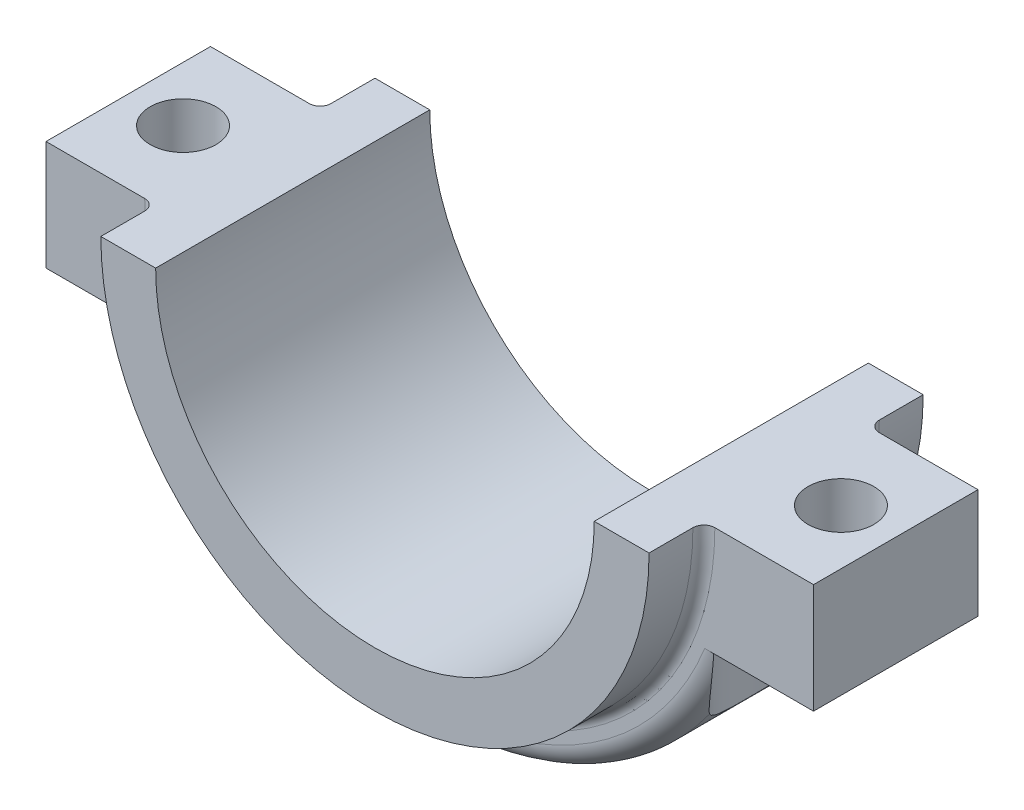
ISO-10303-21;
HEADER;
FILE_DESCRIPTION(('STEP AP214'),'2;1');
FILE_NAME('part.step','',(''),(''),'','','');
FILE_SCHEMA(('AUTOMOTIVE_DESIGN { 1 0 10303 214 1 1 1 1 }'));
ENDSEC;
DATA;
#1=APPLICATION_CONTEXT('core data for automotive mechanical design processes');
#2=APPLICATION_PROTOCOL_DEFINITION('international standard','automotive_design',2000,#1);
#3=PRODUCT_CONTEXT('',#1,'mechanical');
#4=PRODUCT('Part','Part','',(#3));
#5=PRODUCT_RELATED_PRODUCT_CATEGORY('part','',(#4));
#6=PRODUCT_DEFINITION_FORMATION('','',#4);
#7=PRODUCT_DEFINITION_CONTEXT('part definition',#1,'design');
#8=PRODUCT_DEFINITION('design','',#6,#7);
#9=PRODUCT_DEFINITION_SHAPE('','',#8);
#10=(LENGTH_UNIT() NAMED_UNIT(*) SI_UNIT(.MILLI.,.METRE.));
#11=(NAMED_UNIT(*) PLANE_ANGLE_UNIT() SI_UNIT($,.RADIAN.));
#12=(NAMED_UNIT(*) SI_UNIT($,.STERADIAN.) SOLID_ANGLE_UNIT());
#13=UNCERTAINTY_MEASURE_WITH_UNIT(LENGTH_MEASURE(1.E-05),#10,'distance_accuracy_value','');
#14=(GEOMETRIC_REPRESENTATION_CONTEXT(3) GLOBAL_UNCERTAINTY_ASSIGNED_CONTEXT((#13)) GLOBAL_UNIT_ASSIGNED_CONTEXT((#10,
#11,#12)) REPRESENTATION_CONTEXT('',''));
#15=CARTESIAN_POINT('',(0.,0.,0.));
#16=DIRECTION('',(0.,0.,1.));
#17=DIRECTION('',(1.,0.,0.));
#18=AXIS2_PLACEMENT_3D('',#15,#16,#17);
#19=CARTESIAN_POINT('',(0.,0.,15.));
#20=DIRECTION('',(0.,0.,-1.));
#21=DIRECTION('',(-1.,0.,0.));
#22=AXIS2_PLACEMENT_3D('',#19,#20,#21);
#23=CYLINDRICAL_SURFACE('',#22,58.);
#24=CARTESIAN_POINT('',(52.,-25.6904651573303,15.));
#25=CARTESIAN_POINT('',(51.8464410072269,-26.0012966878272,14.9180901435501));
#26=CARTESIAN_POINT('',(51.6905222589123,-26.3098603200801,14.8319155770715));
#27=CARTESIAN_POINT('',(51.3743247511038,-26.9220597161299,14.6502925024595));
#28=CARTESIAN_POINT('',(51.2140451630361,-27.2256945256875,14.5548422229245));
#29=CARTESIAN_POINT('',(50.8891075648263,-27.8283353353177,14.3536834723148));
#30=CARTESIAN_POINT('',(50.7244389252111,-28.127326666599,14.2479480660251));
#31=CARTESIAN_POINT('',(50.3916528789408,-28.7192737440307,14.025679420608));
#32=CARTESIAN_POINT('',(50.2235356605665,-29.0122298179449,13.9091467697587));
#33=CARTESIAN_POINT('',(49.7104094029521,-29.8887420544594,13.5389800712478));
#34=CARTESIAN_POINT('',(49.360814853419,-30.4621907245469,13.2673101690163));
#35=CARTESIAN_POINT('',(48.6559783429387,-31.5757674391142,12.6698951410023));
#36=CARTESIAN_POINT('',(48.3007436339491,-32.115934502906,12.3442150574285));
#37=CARTESIAN_POINT('',(47.7239295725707,-32.963370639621,11.7642584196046));
#38=CARTESIAN_POINT('',(47.5016328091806,-33.2827295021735,11.5282838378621));
#39=CARTESIAN_POINT('',(47.0604799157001,-33.9036295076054,11.0308360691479));
#40=CARTESIAN_POINT('',(46.8416239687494,-34.2051697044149,10.7693615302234));
#41=CARTESIAN_POINT('',(46.4112812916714,-34.7868273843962,10.2209439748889));
#42=CARTESIAN_POINT('',(46.1997677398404,-35.0670286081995,9.93411119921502));
#43=CARTESIAN_POINT('',(45.7865955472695,-35.6048113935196,9.33337846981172));
#44=CARTESIAN_POINT('',(45.5849352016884,-35.862396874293,9.01948322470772));
#45=CARTESIAN_POINT('',(45.2260091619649,-36.3136017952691,8.41618811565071));
#46=CARTESIAN_POINT('',(45.066755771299,-36.5109043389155,8.13072465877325));
#47=CARTESIAN_POINT('',(44.7604376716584,-36.8857939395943,7.54096141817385));
#48=CARTESIAN_POINT('',(44.6133704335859,-37.0633850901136,7.2366655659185));
#49=CARTESIAN_POINT('',(44.3338642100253,-37.3972719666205,6.6098417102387));
#50=CARTESIAN_POINT('',(44.2014350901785,-37.5535533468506,6.28730162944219));
#51=CARTESIAN_POINT('',(43.9538884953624,-37.8429911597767,5.62557308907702));
#52=CARTESIAN_POINT('',(43.8387711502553,-37.9761474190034,5.28638450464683));
#53=CARTESIAN_POINT('',(43.6275035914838,-38.2186738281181,4.59069644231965));
#54=CARTESIAN_POINT('',(43.531504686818,-38.3278548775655,4.23408469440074));
#55=CARTESIAN_POINT('',(43.3618321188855,-38.5197086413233,3.50857971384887));
#56=CARTESIAN_POINT('',(43.2881589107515,-38.6023808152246,3.13968623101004));
#57=CARTESIAN_POINT('',(43.1650248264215,-38.7400203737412,2.39304534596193));
#58=CARTESIAN_POINT('',(43.1155473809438,-38.7950067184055,2.01530418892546));
#59=CARTESIAN_POINT('',(43.0420315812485,-38.8765555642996,1.25433467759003));
#60=CARTESIAN_POINT('',(43.0179896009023,-38.9031221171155,0.871107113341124));
#61=CARTESIAN_POINT('',(42.9974413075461,-38.9258292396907,0.154406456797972));
#62=CARTESIAN_POINT('',(42.9976832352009,-38.9255628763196,-0.178868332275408));
#63=CARTESIAN_POINT('',(43.0177090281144,-38.9034310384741,-0.844086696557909));
#64=CARTESIAN_POINT('',(43.0374907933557,-38.8815678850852,-1.17603041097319));
#65=CARTESIAN_POINT('',(43.0961909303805,-38.8164943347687,-1.83602642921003));
#66=CARTESIAN_POINT('',(43.1351052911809,-38.773288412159,-2.1640795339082));
#67=CARTESIAN_POINT('',(43.2313017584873,-38.6660022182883,-2.81401500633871));
#68=CARTESIAN_POINT('',(43.2885841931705,-38.6019215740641,-3.13589726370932));
#69=CARTESIAN_POINT('',(43.4186894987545,-38.4555160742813,-3.76297559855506));
#70=CARTESIAN_POINT('',(43.4910639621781,-38.3737154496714,-4.06838787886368));
#71=CARTESIAN_POINT('',(43.6509444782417,-38.19174912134,-4.66959762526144));
#72=CARTESIAN_POINT('',(43.7384500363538,-38.0915840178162,-4.96539540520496));
#73=CARTESIAN_POINT('',(43.9271768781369,-37.8737887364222,-5.54594690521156));
#74=CARTESIAN_POINT('',(44.0283978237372,-37.7561589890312,-5.83070089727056));
#75=CARTESIAN_POINT('',(44.2430666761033,-37.5043788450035,-6.38813845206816));
#76=CARTESIAN_POINT('',(44.356519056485,-37.3702224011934,-6.66081754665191));
#77=CARTESIAN_POINT('',(44.6058099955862,-37.0724020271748,-7.21952137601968));
#78=CARTESIAN_POINT('',(44.7427528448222,-36.9071319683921,-7.50419817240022));
#79=CARTESIAN_POINT('',(45.0274090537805,-36.559309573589,-8.05719278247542));
#80=CARTESIAN_POINT('',(45.1751266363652,-36.3767504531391,-8.32550410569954));
#81=CARTESIAN_POINT('',(45.6313417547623,-35.8052657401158,-9.10515657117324));
#82=CARTESIAN_POINT('',(45.9530506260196,-35.392357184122,-9.59154106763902));
#83=CARTESIAN_POINT('',(46.5506820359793,-34.6010061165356,-10.4076433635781));
#84=CARTESIAN_POINT('',(46.8230636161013,-34.2319181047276,-10.7493154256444));
#85=CARTESIAN_POINT('',(47.3746924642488,-33.4643354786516,-11.3921436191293));
#86=CARTESIAN_POINT('',(47.6539433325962,-33.0658252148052,-11.6932779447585));
#87=CARTESIAN_POINT('',(48.2149582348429,-32.2423191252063,-12.2585506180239));
#88=CARTESIAN_POINT('',(48.4967277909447,-31.8172281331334,-12.5225435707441));
#89=CARTESIAN_POINT('',(49.0574716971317,-30.9456443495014,-13.0153897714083));
#90=CARTESIAN_POINT('',(49.3364466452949,-30.4991562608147,-13.2442506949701));
#91=CARTESIAN_POINT('',(49.8220028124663,-29.6973399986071,-13.619047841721));
#92=CARTESIAN_POINT('',(50.0298714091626,-29.3458875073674,-13.7716956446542));
#93=CARTESIAN_POINT('',(50.4409685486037,-28.6335081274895,-14.0601549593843));
#94=CARTESIAN_POINT('',(50.6441972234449,-28.2725815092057,-14.1959669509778));
#95=CARTESIAN_POINT('',(51.0432010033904,-27.5456328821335,-14.4509983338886));
#96=CARTESIAN_POINT('',(51.2390274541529,-27.1796882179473,-14.5703587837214));
#97=CARTESIAN_POINT('',(51.624395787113,-26.4404214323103,-14.7952288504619));
#98=CARTESIAN_POINT('',(51.8139391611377,-26.0671010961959,-14.9007417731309));
#99=CARTESIAN_POINT('',(52.,-25.6904651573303,-15.));
#100=B_SPLINE_CURVE_WITH_KNOTS('',3,(#24,#25,#26,#27,#28,#29,#30,#31,#32,#33,#34,#35,#36,#37,
#38,#39,#40,#41,#42,#43,#44,#45,#46,#47,#48,#49,#50,#51,#52,#53,#54,#55,#56,#57,#58,#59,#60,#61,
#62,#63,#64,#65,#66,#67,#68,#69,#70,#71,#72,#73,#74,#75,#76,#77,#78,#79,#80,#81,#82,#83,#84,#85,
#86,#87,#88,#89,#90,#91,#92,#93,#94,#95,#96,#97,#98,#99),.UNSPECIFIED.,.F.,.F.,(4,2,2,2,2,2,2,2,
2,2,2,2,2,2,2,2,2,2,2,2,2,2,2,2,2,2,2,2,2,2,2,2,2,2,2,2,2,4),(0.,1.06870145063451,
2.13760739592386,3.20939213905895,4.28111852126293,6.45200584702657,8.62029759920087,
9.98458948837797,11.3489537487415,12.7076537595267,14.0661178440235,15.2104802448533,
16.354604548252,17.4994953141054,18.6443946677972,19.7980234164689,20.9516756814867,
22.1045368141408,23.2572335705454,24.2558143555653,25.2542878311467,26.2525520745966,
27.2508341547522,28.2228575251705,29.1948491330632,30.1668167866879,31.139141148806,
32.207644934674,33.2765697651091,35.4132354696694,37.1269886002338,38.8416599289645,
40.5628671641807,42.2836978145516,43.5910217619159,44.89830844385,46.1935772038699,
47.4885361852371),.UNSPECIFIED.);
#101=CARTESIAN_POINT('',(47.0385186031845,-33.9319579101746,11.0000000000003));
#102=VERTEX_POINT('',#101);
#103=CARTESIAN_POINT('',(47.0385186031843,-33.931957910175,-11.));
#104=VERTEX_POINT('',#103);
#105=EDGE_CURVE('E411',#102,#104,#100,.T.);
#106=ORIENTED_EDGE('',*,*,#105,.F.);
#107=CARTESIAN_POINT('',(0.,0.,11.));
#108=DIRECTION('',(0.,0.,1.));
#109=DIRECTION('',(1.,0.,0.));
#110=AXIS2_PLACEMENT_3D('',#107,#108,#109);
#111=CIRCLE('',#110,58.);
#112=CARTESIAN_POINT('',(-47.0385186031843,-33.931957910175,11.));
#113=VERTEX_POINT('',#112);
#114=EDGE_CURVE('E302',#102,#113,#111,.F.);
#115=ORIENTED_EDGE('',*,*,#114,.T.);
#116=CARTESIAN_POINT('',(-52.,-25.6904651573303,-15.));
#117=CARTESIAN_POINT('',(-51.8464410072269,-26.0012966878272,-14.9180901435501));
#118=CARTESIAN_POINT('',(-51.6905222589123,-26.3098603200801,-14.8319155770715));
#119=CARTESIAN_POINT('',(-51.3743247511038,-26.9220597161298,-14.6502925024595));
#120=CARTESIAN_POINT('',(-51.2140451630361,-27.2256945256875,-14.5548422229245));
#121=CARTESIAN_POINT('',(-50.8891075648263,-27.8283353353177,-14.3536834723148));
#122=CARTESIAN_POINT('',(-50.7244389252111,-28.127326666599,-14.2479480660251));
#123=CARTESIAN_POINT('',(-50.3916528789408,-28.7192737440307,-14.025679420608));
#124=CARTESIAN_POINT('',(-50.2235356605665,-29.0122298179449,-13.9091467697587));
#125=CARTESIAN_POINT('',(-49.7104094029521,-29.8887420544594,-13.5389800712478));
#126=CARTESIAN_POINT('',(-49.360814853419,-30.4621907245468,-13.2673101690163));
#127=CARTESIAN_POINT('',(-48.6559783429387,-31.5757674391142,-12.6698951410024));
#128=CARTESIAN_POINT('',(-48.3007436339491,-32.115934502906,-12.3442150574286));
#129=CARTESIAN_POINT('',(-47.7239295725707,-32.963370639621,-11.7642584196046));
#130=CARTESIAN_POINT('',(-47.5016328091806,-33.2827295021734,-11.5282838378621));
#131=CARTESIAN_POINT('',(-47.0604799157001,-33.9036295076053,-11.0308360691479));
#132=CARTESIAN_POINT('',(-46.8416239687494,-34.2051697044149,-10.7693615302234));
#133=CARTESIAN_POINT('',(-46.4112812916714,-34.7868273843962,-10.2209439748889));
#134=CARTESIAN_POINT('',(-46.1997677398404,-35.0670286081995,-9.93411119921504));
#135=CARTESIAN_POINT('',(-45.7865955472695,-35.6048113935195,-9.33337846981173));
#136=CARTESIAN_POINT('',(-45.5849352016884,-35.862396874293,-9.01948322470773));
#137=CARTESIAN_POINT('',(-45.226009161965,-36.3136017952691,-8.41618811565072));
#138=CARTESIAN_POINT('',(-45.066755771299,-36.5109043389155,-8.13072465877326));
#139=CARTESIAN_POINT('',(-44.7604376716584,-36.8857939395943,-7.54096141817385));
#140=CARTESIAN_POINT('',(-44.6133704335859,-37.0633850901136,-7.23666556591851));
#141=CARTESIAN_POINT('',(-44.3338642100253,-37.3972719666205,-6.60984171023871));
#142=CARTESIAN_POINT('',(-44.2014350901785,-37.5535533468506,-6.2873016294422));
#143=CARTESIAN_POINT('',(-43.9538884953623,-37.8429911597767,-5.62557308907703));
#144=CARTESIAN_POINT('',(-43.8387711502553,-37.9761474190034,-5.28638450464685));
#145=CARTESIAN_POINT('',(-43.6275035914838,-38.2186738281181,-4.59069644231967));
#146=CARTESIAN_POINT('',(-43.531504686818,-38.3278548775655,-4.23408469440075));
#147=CARTESIAN_POINT('',(-43.3618321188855,-38.5197086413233,-3.50857971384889));
#148=CARTESIAN_POINT('',(-43.2881589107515,-38.6023808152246,-3.13968623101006));
#149=CARTESIAN_POINT('',(-43.1650248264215,-38.7400203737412,-2.39304534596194));
#150=CARTESIAN_POINT('',(-43.1155473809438,-38.7950067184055,-2.01530418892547));
#151=CARTESIAN_POINT('',(-43.0420315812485,-38.8765555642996,-1.25433467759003));
#152=CARTESIAN_POINT('',(-43.0179896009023,-38.9031221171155,-0.871107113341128));
#153=CARTESIAN_POINT('',(-42.9974413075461,-38.9258292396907,-0.154406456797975));
#154=CARTESIAN_POINT('',(-42.9976832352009,-38.9255628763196,0.178868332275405));
#155=CARTESIAN_POINT('',(-43.0177090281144,-38.9034310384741,0.844086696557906));
#156=CARTESIAN_POINT('',(-43.0374907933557,-38.8815678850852,1.17603041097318));
#157=CARTESIAN_POINT('',(-43.0961909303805,-38.8164943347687,1.83602642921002));
#158=CARTESIAN_POINT('',(-43.1351052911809,-38.773288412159,2.1640795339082));
#159=CARTESIAN_POINT('',(-43.2313017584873,-38.6660022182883,2.81401500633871));
#160=CARTESIAN_POINT('',(-43.2885841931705,-38.6019215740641,3.13589726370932));
#161=CARTESIAN_POINT('',(-43.4186894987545,-38.4555160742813,3.76297559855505));
#162=CARTESIAN_POINT('',(-43.4910639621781,-38.3737154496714,4.06838787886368));
#163=CARTESIAN_POINT('',(-43.6509444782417,-38.19174912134,4.66959762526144));
#164=CARTESIAN_POINT('',(-43.7384500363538,-38.0915840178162,4.96539540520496));
#165=CARTESIAN_POINT('',(-43.9271768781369,-37.8737887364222,5.54594690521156));
#166=CARTESIAN_POINT('',(-44.0283978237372,-37.7561589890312,5.83070089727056));
#167=CARTESIAN_POINT('',(-44.2430666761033,-37.5043788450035,6.38813845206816));
#168=CARTESIAN_POINT('',(-44.356519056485,-37.3702224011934,6.6608175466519));
#169=CARTESIAN_POINT('',(-44.6058099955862,-37.0724020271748,7.21952137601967));
#170=CARTESIAN_POINT('',(-44.7427528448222,-36.9071319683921,7.50419817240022));
#171=CARTESIAN_POINT('',(-45.0274090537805,-36.559309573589,8.05719278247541));
#172=CARTESIAN_POINT('',(-45.1751266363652,-36.3767504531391,8.32550410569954));
#173=CARTESIAN_POINT('',(-45.6313417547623,-35.8052657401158,9.10515657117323));
#174=CARTESIAN_POINT('',(-45.9530506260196,-35.392357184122,9.59154106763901));
#175=CARTESIAN_POINT('',(-46.5506820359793,-34.6010061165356,10.4076433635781));
#176=CARTESIAN_POINT('',(-46.8230636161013,-34.2319181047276,10.7493154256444));
#177=CARTESIAN_POINT('',(-47.3746924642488,-33.4643354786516,11.3921436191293));
#178=CARTESIAN_POINT('',(-47.6539433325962,-33.0658252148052,11.6932779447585));
#179=CARTESIAN_POINT('',(-48.2149582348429,-32.2423191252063,12.2585506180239));
#180=CARTESIAN_POINT('',(-48.4967277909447,-31.8172281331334,12.5225435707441));
#181=CARTESIAN_POINT('',(-49.0574716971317,-30.9456443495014,13.0153897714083));
#182=CARTESIAN_POINT('',(-49.3364466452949,-30.4991562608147,13.2442506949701));
#183=CARTESIAN_POINT('',(-49.8220028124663,-29.6973399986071,13.619047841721));
#184=CARTESIAN_POINT('',(-50.0298714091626,-29.3458875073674,13.7716956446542));
#185=CARTESIAN_POINT('',(-50.4409685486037,-28.6335081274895,14.0601549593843));
#186=CARTESIAN_POINT('',(-50.6441972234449,-28.2725815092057,14.1959669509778));
#187=CARTESIAN_POINT('',(-51.0432010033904,-27.5456328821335,14.4509983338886));
#188=CARTESIAN_POINT('',(-51.2390274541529,-27.1796882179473,14.5703587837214));
#189=CARTESIAN_POINT('',(-51.624395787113,-26.4404214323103,14.7952288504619));
#190=CARTESIAN_POINT('',(-51.8139391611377,-26.0671010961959,14.9007417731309));
#191=CARTESIAN_POINT('',(-52.,-25.6904651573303,15.));
#192=B_SPLINE_CURVE_WITH_KNOTS('',3,(#116,#117,#118,#119,#120,#121,#122,#123,#124,#125,#126,
#127,#128,#129,#130,#131,#132,#133,#134,#135,#136,#137,#138,#139,#140,#141,#142,#143,#144,#145,
#146,#147,#148,#149,#150,#151,#152,#153,#154,#155,#156,#157,#158,#159,#160,#161,#162,#163,#164,
#165,#166,#167,#168,#169,#170,#171,#172,#173,#174,#175,#176,#177,#178,#179,#180,#181,#182,#183,
#184,#185,#186,#187,#188,#189,#190,#191),.UNSPECIFIED.,.F.,.F.,(4,2,2,2,2,2,2,2,2,2,2,2,2,2,2,2,
2,2,2,2,2,2,2,2,2,2,2,2,2,2,2,2,2,2,2,2,2,4),(0.,1.06870145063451,2.13760739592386,
3.20939213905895,4.28111852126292,6.45200584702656,8.62029759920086,9.98458948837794,
11.3489537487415,12.7076537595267,14.0661178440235,15.2104802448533,16.354604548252,
17.4994953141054,18.6443946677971,19.7980234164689,20.9516756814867,22.1045368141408,
23.2572335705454,24.2558143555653,25.2542878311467,26.2525520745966,27.2508341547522,
28.2228575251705,29.1948491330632,30.1668167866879,31.139141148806,32.207644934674,
33.2765697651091,35.4132354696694,37.1269886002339,38.8416599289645,40.5628671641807,
42.2836978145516,43.5910217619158,44.89830844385,46.1935772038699,47.4885361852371),.UNSPECIFIED.);
#193=CARTESIAN_POINT('',(-47.0385186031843,-33.931957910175,-11.));
#194=VERTEX_POINT('',#193);
#195=EDGE_CURVE('E270',#194,#113,#192,.T.);
#196=ORIENTED_EDGE('',*,*,#195,.F.);
#197=CARTESIAN_POINT('',(0.,0.,-11.));
#198=DIRECTION('',(0.,0.,1.));
#199=DIRECTION('',(1.,0.,0.));
#200=AXIS2_PLACEMENT_3D('',#197,#198,#199);
#201=CIRCLE('',#200,58.);
#202=EDGE_CURVE('E413',#194,#104,#201,.T.);
#203=ORIENTED_EDGE('',*,*,#202,.T.);
#204=EDGE_LOOP('',(#106,#115,#196,#203));
#205=FACE_BOUND('',#204,.T.);
#206=ADVANCED_FACE('F61',(#205),#23,.T.);
#207=CARTESIAN_POINT('',(0.,0.,15.));
#208=DIRECTION('',(0.,0.,1.));
#209=DIRECTION('',(1.,0.,0.));
#210=AXIS2_PLACEMENT_3D('',#207,#208,#209);
#211=PLANE('',#210);
#212=DIRECTION('',(1.,0.,0.));
#213=VECTOR('',#212,1.);
#214=CARTESIAN_POINT('',(0.,0.,15.));
#215=LINE('',#214,#213);
#216=CARTESIAN_POINT('',(52.,0.,15.));
#217=VERTEX_POINT('',#216);
#218=CARTESIAN_POINT('',(70.,0.,15.));
#219=VERTEX_POINT('',#218);
#220=EDGE_CURVE('E236',#217,#219,#215,.T.);
#221=ORIENTED_EDGE('',*,*,#220,.F.);
#222=CARTESIAN_POINT('',(0.,0.,15.));
#223=DIRECTION('',(0.,0.,1.));
#224=DIRECTION('',(1.,0.,0.));
#225=AXIS2_PLACEMENT_3D('',#222,#223,#224);
#226=CIRCLE('',#225,52.);
#227=CARTESIAN_POINT('',(-52.,0.,15.));
#228=VERTEX_POINT('',#227);
#229=EDGE_CURVE('E76',#217,#228,#226,.F.);
#230=ORIENTED_EDGE('',*,*,#229,.T.);
#231=DIRECTION('',(1.,0.,0.));
#232=VECTOR('',#231,1.);
#233=CARTESIAN_POINT('',(0.,0.,15.));
#234=LINE('',#233,#232);
#235=CARTESIAN_POINT('',(-70.,0.,15.));
#236=VERTEX_POINT('',#235);
#237=EDGE_CURVE('E217',#236,#228,#234,.T.);
#238=ORIENTED_EDGE('',*,*,#237,.F.);
#239=DIRECTION('',(0.,-1.,0.));
#240=VECTOR('',#239,1.);
#241=CARTESIAN_POINT('',(-70.,0.,15.));
#242=LINE('',#241,#240);
#243=CARTESIAN_POINT('',(-70.,-20.,15.));
#244=VERTEX_POINT('',#243);
#245=EDGE_CURVE('E250',#236,#244,#242,.T.);
#246=ORIENTED_EDGE('',*,*,#245,.T.);
#247=DIRECTION('',(1.,0.,0.));
#248=VECTOR('',#247,1.);
#249=CARTESIAN_POINT('',(0.,-20.,15.));
#250=LINE('',#249,#248);
#251=CARTESIAN_POINT('',(-50.1597448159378,-20.,15.));
#252=VERTEX_POINT('',#251);
#253=EDGE_CURVE('E258',#244,#252,#250,.T.);
#254=ORIENTED_EDGE('',*,*,#253,.T.);
#255=CARTESIAN_POINT('',(0.,0.,15.));
#256=DIRECTION('',(0.,0.,1.));
#257=DIRECTION('',(1.,0.,0.));
#258=AXIS2_PLACEMENT_3D('',#255,#256,#257);
#259=CIRCLE('',#258,54.);
#260=CARTESIAN_POINT('',(50.1597448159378,-20.,15.));
#261=VERTEX_POINT('',#260);
#262=EDGE_CURVE('E382',#252,#261,#259,.T.);
#263=ORIENTED_EDGE('',*,*,#262,.T.);
#264=DIRECTION('',(-1.,0.,0.));
#265=VECTOR('',#264,1.);
#266=CARTESIAN_POINT('',(0.,-20.,15.));
#267=LINE('',#266,#265);
#268=CARTESIAN_POINT('',(70.,-20.,15.));
#269=VERTEX_POINT('',#268);
#270=EDGE_CURVE('E213',#269,#261,#267,.T.);
#271=ORIENTED_EDGE('',*,*,#270,.F.);
#272=DIRECTION('',(0.,-1.,0.));
#273=VECTOR('',#272,1.);
#274=CARTESIAN_POINT('',(70.,0.,15.));
#275=LINE('',#274,#273);
#276=EDGE_CURVE('E232',#219,#269,#275,.T.);
#277=ORIENTED_EDGE('',*,*,#276,.F.);
#278=EDGE_LOOP('',(#221,#230,#238,#246,#254,#263,#271,#277));
#279=FACE_BOUND('',#278,.T.);
#280=ADVANCED_FACE('F401',(#279),#211,.T.);
#281=CARTESIAN_POINT('',(0.,0.,-15.));
#282=DIRECTION('',(0.,0.,1.));
#283=DIRECTION('',(1.,0.,0.));
#284=AXIS2_PLACEMENT_3D('',#281,#282,#283);
#285=PLANE('',#284);
#286=DIRECTION('',(1.,0.,0.));
#287=VECTOR('',#286,1.);
#288=CARTESIAN_POINT('',(0.,0.,-15.));
#289=LINE('',#288,#287);
#290=CARTESIAN_POINT('',(-70.,0.,-15.));
#291=VERTEX_POINT('',#290);
#292=CARTESIAN_POINT('',(-52.,0.,-15.));
#293=VERTEX_POINT('',#292);
#294=EDGE_CURVE('E246',#291,#293,#289,.T.);
#295=ORIENTED_EDGE('',*,*,#294,.T.);
#296=CARTESIAN_POINT('',(0.,0.,-15.));
#297=DIRECTION('',(0.,0.,1.));
#298=DIRECTION('',(1.,0.,0.));
#299=AXIS2_PLACEMENT_3D('',#296,#297,#298);
#300=CIRCLE('',#299,52.);
#301=CARTESIAN_POINT('',(52.,0.,-15.));
#302=VERTEX_POINT('',#301);
#303=EDGE_CURVE('E449',#293,#302,#300,.T.);
#304=ORIENTED_EDGE('',*,*,#303,.T.);
#305=DIRECTION('',(1.,0.,0.));
#306=VECTOR('',#305,1.);
#307=CARTESIAN_POINT('',(0.,0.,-15.));
#308=LINE('',#307,#306);
#309=CARTESIAN_POINT('',(70.,0.,-15.));
#310=VERTEX_POINT('',#309);
#311=EDGE_CURVE('E249',#302,#310,#308,.T.);
#312=ORIENTED_EDGE('',*,*,#311,.T.);
#313=DIRECTION('',(0.,-1.,0.));
#314=VECTOR('',#313,1.);
#315=CARTESIAN_POINT('',(70.,0.,-15.));
#316=LINE('',#315,#314);
#317=CARTESIAN_POINT('',(70.,-20.,-15.));
#318=VERTEX_POINT('',#317);
#319=EDGE_CURVE('E252',#310,#318,#316,.T.);
#320=ORIENTED_EDGE('',*,*,#319,.T.);
#321=DIRECTION('',(-1.,0.,0.));
#322=VECTOR('',#321,1.);
#323=CARTESIAN_POINT('',(0.,-20.,-15.));
#324=LINE('',#323,#322);
#325=CARTESIAN_POINT('',(50.1597448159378,-20.,-15.));
#326=VERTEX_POINT('',#325);
#327=EDGE_CURVE('E255',#318,#326,#324,.T.);
#328=ORIENTED_EDGE('',*,*,#327,.T.);
#329=CARTESIAN_POINT('',(0.,0.,-15.));
#330=DIRECTION('',(0.,0.,1.));
#331=DIRECTION('',(1.,0.,0.));
#332=AXIS2_PLACEMENT_3D('',#329,#330,#331);
#333=CIRCLE('',#332,54.);
#334=CARTESIAN_POINT('',(-50.1597448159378,-20.,-15.));
#335=VERTEX_POINT('',#334);
#336=EDGE_CURVE('E361',#326,#335,#333,.F.);
#337=ORIENTED_EDGE('',*,*,#336,.T.);
#338=DIRECTION('',(1.,0.,0.));
#339=VECTOR('',#338,1.);
#340=CARTESIAN_POINT('',(0.,-20.,-15.));
#341=LINE('',#340,#339);
#342=CARTESIAN_POINT('',(-70.,-20.,-15.));
#343=VERTEX_POINT('',#342);
#344=EDGE_CURVE('E242',#343,#335,#341,.T.);
#345=ORIENTED_EDGE('',*,*,#344,.F.);
#346=DIRECTION('',(0.,-1.,0.));
#347=VECTOR('',#346,1.);
#348=CARTESIAN_POINT('',(-70.,0.,-15.));
#349=LINE('',#348,#347);
#350=EDGE_CURVE('E231',#291,#343,#349,.T.);
#351=ORIENTED_EDGE('',*,*,#350,.F.);
#352=EDGE_LOOP('',(#295,#304,#312,#320,#328,#337,#345,#351));
#353=FACE_BOUND('',#352,.T.);
#354=ADVANCED_FACE('F393',(#353),#285,.F.);
#355=CARTESIAN_POINT('',(0.,-20.,15.));
#356=DIRECTION('',(0.,1.,0.));
#357=DIRECTION('',(-1.,0.,0.));
#358=AXIS2_PLACEMENT_3D('',#355,#356,#357);
#359=PLANE('',#358);
#360=ORIENTED_EDGE('',*,*,#344,.T.);
#361=CARTESIAN_POINT('',(-50.1597448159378,-20.,-15.));
#362=CARTESIAN_POINT('',(-50.281125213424,-20.,-15.0000055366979));
#363=CARTESIAN_POINT('',(-50.402508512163,-20.,-14.9952328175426));
#364=CARTESIAN_POINT('',(-50.6437660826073,-20.,-14.9762031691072));
#365=CARTESIAN_POINT('',(-50.7636450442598,-20.,-14.9620056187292));
#366=CARTESIAN_POINT('',(-51.0019188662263,-20.,-14.9241970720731));
#367=CARTESIAN_POINT('',(-51.1203136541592,-20.,-14.9005856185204));
#368=CARTESIAN_POINT('',(-51.3555850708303,-20.,-14.843841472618));
#369=CARTESIAN_POINT('',(-51.4724474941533,-20.,-14.8106499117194));
#370=CARTESIAN_POINT('',(-51.5877788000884,-20.,-14.7727632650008));
#371=B_SPLINE_CURVE_WITH_KNOTS('',3,(#361,#362,#363,#364,#365,#366,#367,#368,#369,#370),
.UNSPECIFIED.,.F.,.F.,(4,2,2,2,4),(0.,0.364051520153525,0.725830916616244,1.0876278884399,
1.45169719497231),.UNSPECIFIED.);
#372=CARTESIAN_POINT('',(-51.5877788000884,-20.,-14.7727632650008));
#373=VERTEX_POINT('',#372);
#374=EDGE_CURVE('E335',#335,#373,#371,.T.);
#375=ORIENTED_EDGE('',*,*,#374,.T.);
#376=CARTESIAN_POINT('',(-60.,-20.,0.));
#377=DIRECTION('',(0.,-1.,0.));
#378=DIRECTION('',(1.,0.,0.));
#379=AXIS2_PLACEMENT_3D('',#376,#377,#378);
#380=CIRCLE('',#379,17.);
#381=CARTESIAN_POINT('',(-51.5877788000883,-20.,14.7727632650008));
#382=VERTEX_POINT('',#381);
#383=EDGE_CURVE('E279',#373,#382,#380,.T.);
#384=ORIENTED_EDGE('',*,*,#383,.T.);
#385=CARTESIAN_POINT('',(-51.5877788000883,-20.,14.7727632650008));
#386=CARTESIAN_POINT('',(-51.4724474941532,-20.,14.8106499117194));
#387=CARTESIAN_POINT('',(-51.3555850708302,-20.,14.843841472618));
#388=CARTESIAN_POINT('',(-51.1203136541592,-20.,14.9005856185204));
#389=CARTESIAN_POINT('',(-51.0019188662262,-20.,14.9241970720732));
#390=CARTESIAN_POINT('',(-50.7636450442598,-20.,14.9620056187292));
#391=CARTESIAN_POINT('',(-50.6437660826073,-20.,14.9762031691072));
#392=CARTESIAN_POINT('',(-50.4025085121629,-20.,14.9952328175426));
#393=CARTESIAN_POINT('',(-50.2811252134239,-20.,15.0000055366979));
#394=CARTESIAN_POINT('',(-50.1597448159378,-20.,15.));
#395=B_SPLINE_CURVE_WITH_KNOTS('',3,(#385,#386,#387,#388,#389,#390,#391,#392,#393,#394),
.UNSPECIFIED.,.F.,.F.,(4,2,2,2,4),(0.,0.364069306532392,0.725866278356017,1.08764567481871,
1.4516971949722),.UNSPECIFIED.);
#396=EDGE_CURVE('E336',#382,#252,#395,.T.);
#397=ORIENTED_EDGE('',*,*,#396,.T.);
#398=ORIENTED_EDGE('',*,*,#253,.F.);
#399=DIRECTION('',(0.,0.,-1.));
#400=VECTOR('',#399,1.);
#401=CARTESIAN_POINT('',(-70.,-20.,15.));
#402=LINE('',#401,#400);
#403=EDGE_CURVE('E240',#244,#343,#402,.T.);
#404=ORIENTED_EDGE('',*,*,#403,.T.);
#405=EDGE_LOOP('',(#360,#375,#384,#397,#398,#404));
#406=FACE_BOUND('',#405,.T.);
#407=CARTESIAN_POINT('',(-60.,-20.,0.));
#408=DIRECTION('',(0.,-1.,0.));
#409=DIRECTION('',(1.,0.,0.));
#410=AXIS2_PLACEMENT_3D('',#407,#408,#409);
#411=CIRCLE('',#410,6.);
#412=CARTESIAN_POINT('',(-54.,-20.,0.));
#413=VERTEX_POINT('',#412);
#414=EDGE_CURVE('E269',#413,#413,#411,.T.);
#415=ORIENTED_EDGE('',*,*,#414,.F.);
#416=EDGE_LOOP('',(#415));
#417=FACE_BOUND('',#416,.T.);
#418=ADVANCED_FACE('F352',(#406,#417),#359,.F.);
#419=CARTESIAN_POINT('',(0.,0.,25.));
#420=DIRECTION('',(0.,0.,-1.));
#421=DIRECTION('',(-1.,0.,0.));
#422=AXIS2_PLACEMENT_3D('',#419,#420,#421);
#423=CYLINDRICAL_SURFACE('',#422,50.);
#424=DIRECTION('',(0.,0.,-1.));
#425=VECTOR('',#424,1.);
#426=CARTESIAN_POINT('',(50.,0.,25.));
#427=LINE('',#426,#425);
#428=CARTESIAN_POINT('',(50.,0.,-17.));
#429=VERTEX_POINT('',#428);
#430=CARTESIAN_POINT('',(50.,0.,-25.));
#431=VERTEX_POINT('',#430);
#432=EDGE_CURVE('E222',#429,#431,#427,.T.);
#433=ORIENTED_EDGE('',*,*,#432,.F.);
#434=CARTESIAN_POINT('',(0.,0.,-17.));
#435=DIRECTION('',(0.,0.,1.));
#436=DIRECTION('',(1.,0.,0.));
#437=AXIS2_PLACEMENT_3D('',#434,#435,#436);
#438=CIRCLE('',#437,50.);
#439=CARTESIAN_POINT('',(-50.,0.,-17.));
#440=VERTEX_POINT('',#439);
#441=EDGE_CURVE('E442',#429,#440,#438,.F.);
#442=ORIENTED_EDGE('',*,*,#441,.T.);
#443=DIRECTION('',(0.,0.,-1.));
#444=VECTOR('',#443,1.);
#445=CARTESIAN_POINT('',(-50.,0.,25.));
#446=LINE('',#445,#444);
#447=CARTESIAN_POINT('',(-50.,0.,-25.));
#448=VERTEX_POINT('',#447);
#449=EDGE_CURVE('E218',#440,#448,#446,.T.);
#450=ORIENTED_EDGE('',*,*,#449,.T.);
#451=CARTESIAN_POINT('',(0.,0.,-25.));
#452=DIRECTION('',(0.,0.,1.));
#453=DIRECTION('',(1.,0.,0.));
#454=AXIS2_PLACEMENT_3D('',#451,#452,#453);
#455=CIRCLE('',#454,50.);
#456=EDGE_CURVE('E205',#448,#431,#455,.T.);
#457=ORIENTED_EDGE('',*,*,#456,.T.);
#458=EDGE_LOOP('',(#433,#442,#450,#457));
#459=FACE_BOUND('',#458,.T.);
#460=ADVANCED_FACE('F392',(#459),#423,.T.);
#461=CARTESIAN_POINT('',(0.,0.,25.));
#462=DIRECTION('',(0.,1.,0.));
#463=DIRECTION('',(0.,0.,1.));
#464=AXIS2_PLACEMENT_3D('',#461,#462,#463);
#465=PLANE('',#464);
#466=CARTESIAN_POINT('',(-60.,0.,0.));
#467=DIRECTION('',(0.,1.,0.));
#468=DIRECTION('',(0.,0.,1.));
#469=AXIS2_PLACEMENT_3D('',#466,#467,#468);
#470=CIRCLE('',#469,6.);
#471=CARTESIAN_POINT('',(-60.,0.,6.));
#472=VERTEX_POINT('',#471);
#473=EDGE_CURVE('E239',#472,#472,#470,.T.);
#474=ORIENTED_EDGE('',*,*,#473,.F.);
#475=EDGE_LOOP('',(#474));
#476=FACE_BOUND('',#475,.T.);
#477=DIRECTION('',(1.,0.,0.));
#478=VECTOR('',#477,1.);
#479=CARTESIAN_POINT('',(0.,0.,-25.));
#480=LINE('',#479,#478);
#481=CARTESIAN_POINT('',(-40.,0.,-25.));
#482=VERTEX_POINT('',#481);
#483=EDGE_CURVE('E189',#448,#482,#480,.T.);
#484=ORIENTED_EDGE('',*,*,#483,.F.);
#485=ORIENTED_EDGE('',*,*,#449,.F.);
#486=CARTESIAN_POINT('',(-52.,0.,-17.));
#487=DIRECTION('',(0.,1.,0.));
#488=DIRECTION('',(0.,0.,1.));
#489=AXIS2_PLACEMENT_3D('',#486,#487,#488);
#490=CIRCLE('',#489,2.);
#491=EDGE_CURVE('E445',#440,#293,#490,.F.);
#492=ORIENTED_EDGE('',*,*,#491,.T.);
#493=ORIENTED_EDGE('',*,*,#294,.F.);
#494=DIRECTION('',(0.,0.,-1.));
#495=VECTOR('',#494,1.);
#496=CARTESIAN_POINT('',(-70.,0.,15.));
#497=LINE('',#496,#495);
#498=EDGE_CURVE('E237',#236,#291,#497,.T.);
#499=ORIENTED_EDGE('',*,*,#498,.F.);
#500=ORIENTED_EDGE('',*,*,#237,.T.);
#501=CARTESIAN_POINT('',(-52.,0.,17.));
#502=DIRECTION('',(0.,1.,0.));
#503=DIRECTION('',(0.,0.,1.));
#504=AXIS2_PLACEMENT_3D('',#501,#502,#503);
#505=CIRCLE('',#504,2.);
#506=CARTESIAN_POINT('',(-50.,0.,17.));
#507=VERTEX_POINT('',#506);
#508=EDGE_CURVE('E14',#228,#507,#505,.F.);
#509=ORIENTED_EDGE('',*,*,#508,.T.);
#510=CARTESIAN_POINT('',(-50.,0.,25.));
#511=VERTEX_POINT('',#510);
#512=EDGE_CURVE('E196',#511,#507,#446,.T.);
#513=ORIENTED_EDGE('',*,*,#512,.F.);
#514=DIRECTION('',(1.,0.,0.));
#515=VECTOR('',#514,1.);
#516=CARTESIAN_POINT('',(0.,0.,25.));
#517=LINE('',#516,#515);
#518=CARTESIAN_POINT('',(-40.,0.,25.));
#519=VERTEX_POINT('',#518);
#520=EDGE_CURVE('E191',#511,#519,#517,.T.);
#521=ORIENTED_EDGE('',*,*,#520,.T.);
#522=DIRECTION('',(0.,0.,-1.));
#523=VECTOR('',#522,1.);
#524=CARTESIAN_POINT('',(-40.,0.,25.));
#525=LINE('',#524,#523);
#526=EDGE_CURVE('E185',#519,#482,#525,.T.);
#527=ORIENTED_EDGE('',*,*,#526,.T.);
#528=EDGE_LOOP('',(#484,#485,#492,#493,#499,#500,#509,#513,#521,#527));
#529=FACE_BOUND('',#528,.T.);
#530=ADVANCED_FACE('F187',(#476,#529),#465,.T.);
#531=ORIENTED_EDGE('',*,*,#512,.T.);
#532=CARTESIAN_POINT('',(0.,0.,17.));
#533=DIRECTION('',(0.,0.,1.));
#534=DIRECTION('',(1.,0.,0.));
#535=AXIS2_PLACEMENT_3D('',#532,#533,#534);
#536=CIRCLE('',#535,50.);
#537=CARTESIAN_POINT('',(50.,0.,17.));
#538=VERTEX_POINT('',#537);
#539=EDGE_CURVE('E454',#507,#538,#536,.T.);
#540=ORIENTED_EDGE('',*,*,#539,.T.);
#541=CARTESIAN_POINT('',(50.,0.,25.));
#542=VERTEX_POINT('',#541);
#543=EDGE_CURVE('E226',#542,#538,#427,.T.);
#544=ORIENTED_EDGE('',*,*,#543,.F.);
#545=CARTESIAN_POINT('',(0.,0.,25.));
#546=DIRECTION('',(0.,0.,1.));
#547=DIRECTION('',(1.,0.,0.));
#548=AXIS2_PLACEMENT_3D('',#545,#546,#547);
#549=CIRCLE('',#548,50.);
#550=EDGE_CURVE('E206',#511,#542,#549,.T.);
#551=ORIENTED_EDGE('',*,*,#550,.F.);
#552=EDGE_LOOP('',(#531,#540,#544,#551));
#553=FACE_BOUND('',#552,.T.);
#554=ADVANCED_FACE('F400',(#553),#423,.T.);
#555=CARTESIAN_POINT('',(0.,0.,25.));
#556=DIRECTION('',(0.,1.,0.));
#557=DIRECTION('',(0.,0.,1.));
#558=AXIS2_PLACEMENT_3D('',#555,#556,#557);
#559=PLANE('',#558);
#560=CARTESIAN_POINT('',(60.,0.,0.));
#561=DIRECTION('',(0.,1.,0.));
#562=DIRECTION('',(0.,0.,1.));
#563=AXIS2_PLACEMENT_3D('',#560,#561,#562);
#564=CIRCLE('',#563,6.);
#565=CARTESIAN_POINT('',(60.,0.,6.));
#566=VERTEX_POINT('',#565);
#567=EDGE_CURVE('E243',#566,#566,#564,.T.);
#568=ORIENTED_EDGE('',*,*,#567,.F.);
#569=EDGE_LOOP('',(#568));
#570=FACE_BOUND('',#569,.T.);
#571=DIRECTION('',(1.,0.,0.));
#572=VECTOR('',#571,1.);
#573=CARTESIAN_POINT('',(0.,0.,-25.));
#574=LINE('',#573,#572);
#575=CARTESIAN_POINT('',(40.,0.,-25.));
#576=VERTEX_POINT('',#575);
#577=EDGE_CURVE('E211',#576,#431,#574,.T.);
#578=ORIENTED_EDGE('',*,*,#577,.F.);
#579=DIRECTION('',(0.,0.,-1.));
#580=VECTOR('',#579,1.);
#581=CARTESIAN_POINT('',(40.,0.,25.));
#582=LINE('',#581,#580);
#583=CARTESIAN_POINT('',(40.,0.,25.));
#584=VERTEX_POINT('',#583);
#585=EDGE_CURVE('E209',#584,#576,#582,.T.);
#586=ORIENTED_EDGE('',*,*,#585,.F.);
#587=DIRECTION('',(1.,0.,0.));
#588=VECTOR('',#587,1.);
#589=CARTESIAN_POINT('',(0.,0.,25.));
#590=LINE('',#589,#588);
#591=EDGE_CURVE('E223',#584,#542,#590,.T.);
#592=ORIENTED_EDGE('',*,*,#591,.T.);
#593=ORIENTED_EDGE('',*,*,#543,.T.);
#594=CARTESIAN_POINT('',(52.,0.,17.));
#595=DIRECTION('',(0.,1.,0.));
#596=DIRECTION('',(0.,0.,1.));
#597=AXIS2_PLACEMENT_3D('',#594,#595,#596);
#598=CIRCLE('',#597,2.);
#599=EDGE_CURVE('E69',#538,#217,#598,.F.);
#600=ORIENTED_EDGE('',*,*,#599,.T.);
#601=ORIENTED_EDGE('',*,*,#220,.T.);
#602=DIRECTION('',(0.,0.,-1.));
#603=VECTOR('',#602,1.);
#604=CARTESIAN_POINT('',(70.,0.,15.));
#605=LINE('',#604,#603);
#606=EDGE_CURVE('E233',#219,#310,#605,.T.);
#607=ORIENTED_EDGE('',*,*,#606,.T.);
#608=ORIENTED_EDGE('',*,*,#311,.F.);
#609=CARTESIAN_POINT('',(52.,0.,-17.));
#610=DIRECTION('',(0.,1.,0.));
#611=DIRECTION('',(0.,0.,1.));
#612=AXIS2_PLACEMENT_3D('',#609,#610,#611);
#613=CIRCLE('',#612,2.);
#614=EDGE_CURVE('E440',#302,#429,#613,.F.);
#615=ORIENTED_EDGE('',*,*,#614,.T.);
#616=ORIENTED_EDGE('',*,*,#432,.T.);
#617=EDGE_LOOP('',(#578,#586,#592,#593,#600,#601,#607,#608,#615,#616));
#618=FACE_BOUND('',#617,.T.);
#619=ADVANCED_FACE('F438',(#570,#618),#559,.T.);
#620=CARTESIAN_POINT('',(0.,0.,25.));
#621=DIRECTION('',(0.,0.,-1.));
#622=DIRECTION('',(-1.,0.,0.));
#623=AXIS2_PLACEMENT_3D('',#620,#621,#622);
#624=CYLINDRICAL_SURFACE('',#623,40.);
#625=CARTESIAN_POINT('',(0.,0.,-25.));
#626=DIRECTION('',(0.,0.,1.));
#627=DIRECTION('',(1.,0.,0.));
#628=AXIS2_PLACEMENT_3D('',#625,#626,#627);
#629=CIRCLE('',#628,40.);
#630=EDGE_CURVE('E203',#482,#576,#629,.T.);
#631=ORIENTED_EDGE('',*,*,#630,.F.);
#632=ORIENTED_EDGE('',*,*,#526,.F.);
#633=CARTESIAN_POINT('',(0.,0.,25.));
#634=DIRECTION('',(0.,0.,1.));
#635=DIRECTION('',(1.,0.,0.));
#636=AXIS2_PLACEMENT_3D('',#633,#634,#635);
#637=CIRCLE('',#636,40.);
#638=EDGE_CURVE('E220',#519,#584,#637,.T.);
#639=ORIENTED_EDGE('',*,*,#638,.T.);
#640=ORIENTED_EDGE('',*,*,#585,.T.);
#641=EDGE_LOOP('',(#631,#632,#639,#640));
#642=FACE_BOUND('',#641,.T.);
#643=ADVANCED_FACE('F208',(#642),#624,.F.);
#644=CARTESIAN_POINT('',(0.,0.,25.));
#645=DIRECTION('',(0.,0.,1.));
#646=DIRECTION('',(1.,0.,0.));
#647=AXIS2_PLACEMENT_3D('',#644,#645,#646);
#648=PLANE('',#647);
#649=ORIENTED_EDGE('',*,*,#520,.F.);
#650=ORIENTED_EDGE('',*,*,#550,.T.);
#651=ORIENTED_EDGE('',*,*,#591,.F.);
#652=ORIENTED_EDGE('',*,*,#638,.F.);
#653=EDGE_LOOP('',(#649,#650,#651,#652));
#654=FACE_BOUND('',#653,.T.);
#655=ADVANCED_FACE('F474',(#654),#648,.T.);
#656=CARTESIAN_POINT('',(0.,0.,-25.));
#657=DIRECTION('',(0.,0.,1.));
#658=DIRECTION('',(1.,0.,0.));
#659=AXIS2_PLACEMENT_3D('',#656,#657,#658);
#660=PLANE('',#659);
#661=ORIENTED_EDGE('',*,*,#483,.T.);
#662=ORIENTED_EDGE('',*,*,#630,.T.);
#663=ORIENTED_EDGE('',*,*,#577,.T.);
#664=ORIENTED_EDGE('',*,*,#456,.F.);
#665=EDGE_LOOP('',(#661,#662,#663,#664));
#666=FACE_BOUND('',#665,.T.);
#667=ADVANCED_FACE('F201',(#666),#660,.F.);
#668=CARTESIAN_POINT('',(0.,-20.,15.));
#669=DIRECTION('',(0.,-1.,0.));
#670=DIRECTION('',(1.,0.,0.));
#671=AXIS2_PLACEMENT_3D('',#668,#669,#670);
#672=PLANE('',#671);
#673=ORIENTED_EDGE('',*,*,#270,.T.);
#674=CARTESIAN_POINT('',(50.1597448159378,-20.,15.));
#675=CARTESIAN_POINT('',(50.281125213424,-20.,15.0000055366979));
#676=CARTESIAN_POINT('',(50.402508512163,-20.,14.9952328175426));
#677=CARTESIAN_POINT('',(50.6437660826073,-20.,14.9762031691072));
#678=CARTESIAN_POINT('',(50.7636450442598,-20.,14.9620056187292));
#679=CARTESIAN_POINT('',(51.0019188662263,-20.,14.9241970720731));
#680=CARTESIAN_POINT('',(51.1203136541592,-20.,14.9005856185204));
#681=CARTESIAN_POINT('',(51.3555850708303,-20.,14.843841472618));
#682=CARTESIAN_POINT('',(51.4724474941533,-20.,14.8106499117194));
#683=CARTESIAN_POINT('',(51.5877788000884,-20.,14.7727632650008));
#684=B_SPLINE_CURVE_WITH_KNOTS('',3,(#674,#675,#676,#677,#678,#679,#680,#681,#682,#683),
.UNSPECIFIED.,.F.,.F.,(4,2,2,2,4),(0.,0.364051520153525,0.725830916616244,1.0876278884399,
1.45169719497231),.UNSPECIFIED.);
#685=CARTESIAN_POINT('',(51.5877788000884,-20.,14.7727632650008));
#686=VERTEX_POINT('',#685);
#687=EDGE_CURVE('E357',#261,#686,#684,.T.);
#688=ORIENTED_EDGE('',*,*,#687,.T.);
#689=CARTESIAN_POINT('',(60.,-20.,0.));
#690=DIRECTION('',(0.,-1.,0.));
#691=DIRECTION('',(1.,0.,0.));
#692=AXIS2_PLACEMENT_3D('',#689,#690,#691);
#693=CIRCLE('',#692,17.);
#694=CARTESIAN_POINT('',(51.5877788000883,-20.,-14.7727632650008));
#695=VERTEX_POINT('',#694);
#696=EDGE_CURVE('E415',#686,#695,#693,.T.);
#697=ORIENTED_EDGE('',*,*,#696,.T.);
#698=CARTESIAN_POINT('',(51.5877788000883,-20.,-14.7727632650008));
#699=CARTESIAN_POINT('',(51.4724474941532,-20.,-14.8106499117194));
#700=CARTESIAN_POINT('',(51.3555850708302,-20.,-14.843841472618));
#701=CARTESIAN_POINT('',(51.1203136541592,-20.,-14.9005856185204));
#702=CARTESIAN_POINT('',(51.0019188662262,-20.,-14.9241970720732));
#703=CARTESIAN_POINT('',(50.7636450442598,-20.,-14.9620056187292));
#704=CARTESIAN_POINT('',(50.6437660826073,-20.,-14.9762031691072));
#705=CARTESIAN_POINT('',(50.4025085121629,-20.,-14.9952328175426));
#706=CARTESIAN_POINT('',(50.2811252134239,-20.,-15.0000055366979));
#707=CARTESIAN_POINT('',(50.1597448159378,-20.,-15.));
#708=B_SPLINE_CURVE_WITH_KNOTS('',3,(#698,#699,#700,#701,#702,#703,#704,#705,#706,#707),
.UNSPECIFIED.,.F.,.F.,(4,2,2,2,4),(0.,0.36406930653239,0.725866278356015,1.08764567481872,
1.45169719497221),.UNSPECIFIED.);
#709=EDGE_CURVE('E328',#695,#326,#708,.T.);
#710=ORIENTED_EDGE('',*,*,#709,.T.);
#711=ORIENTED_EDGE('',*,*,#327,.F.);
#712=DIRECTION('',(0.,0.,-1.));
#713=VECTOR('',#712,1.);
#714=CARTESIAN_POINT('',(70.,-20.,15.));
#715=LINE('',#714,#713);
#716=EDGE_CURVE('E229',#269,#318,#715,.T.);
#717=ORIENTED_EDGE('',*,*,#716,.F.);
#718=EDGE_LOOP('',(#673,#688,#697,#710,#711,#717));
#719=FACE_BOUND('',#718,.T.);
#720=CARTESIAN_POINT('',(60.,-20.,0.));
#721=DIRECTION('',(0.,-1.,0.));
#722=DIRECTION('',(1.,0.,0.));
#723=AXIS2_PLACEMENT_3D('',#720,#721,#722);
#724=CIRCLE('',#723,6.);
#725=CARTESIAN_POINT('',(66.,-20.,0.));
#726=VERTEX_POINT('',#725);
#727=EDGE_CURVE('E278',#726,#726,#724,.T.);
#728=ORIENTED_EDGE('',*,*,#727,.F.);
#729=EDGE_LOOP('',(#728));
#730=FACE_BOUND('',#729,.T.);
#731=ADVANCED_FACE('F346',(#719,#730),#672,.T.);
#732=CARTESIAN_POINT('',(70.,0.,15.));
#733=DIRECTION('',(1.,0.,0.));
#734=DIRECTION('',(0.,0.,-1.));
#735=AXIS2_PLACEMENT_3D('',#732,#733,#734);
#736=PLANE('',#735);
#737=ORIENTED_EDGE('',*,*,#319,.F.);
#738=ORIENTED_EDGE('',*,*,#606,.F.);
#739=ORIENTED_EDGE('',*,*,#276,.T.);
#740=ORIENTED_EDGE('',*,*,#716,.T.);
#741=EDGE_LOOP('',(#737,#738,#739,#740));
#742=FACE_BOUND('',#741,.T.);
#743=ADVANCED_FACE('F350',(#742),#736,.T.);
#744=CARTESIAN_POINT('',(-70.,0.,15.));
#745=DIRECTION('',(1.,0.,0.));
#746=DIRECTION('',(0.,0.,-1.));
#747=AXIS2_PLACEMENT_3D('',#744,#745,#746);
#748=PLANE('',#747);
#749=ORIENTED_EDGE('',*,*,#350,.T.);
#750=ORIENTED_EDGE('',*,*,#403,.F.);
#751=ORIENTED_EDGE('',*,*,#245,.F.);
#752=ORIENTED_EDGE('',*,*,#498,.T.);
#753=EDGE_LOOP('',(#749,#750,#751,#752));
#754=FACE_BOUND('',#753,.T.);
#755=ADVANCED_FACE('F493',(#754),#748,.F.);
#756=CARTESIAN_POINT('',(-60.,10.,0.));
#757=DIRECTION('',(0.,-1.,0.));
#758=DIRECTION('',(1.,0.,0.));
#759=AXIS2_PLACEMENT_3D('',#756,#757,#758);
#760=CYLINDRICAL_SURFACE('',#759,6.);
#761=ORIENTED_EDGE('',*,*,#473,.T.);
#762=EDGE_LOOP('',(#761));
#763=FACE_BOUND('',#762,.T.);
#764=ORIENTED_EDGE('',*,*,#414,.T.);
#765=EDGE_LOOP('',(#764));
#766=FACE_BOUND('',#765,.T.);
#767=ADVANCED_FACE('F288',(#763,#766),#760,.F.);
#768=CARTESIAN_POINT('',(-60.,-50.,0.));
#769=DIRECTION('',(0.,1.,0.));
#770=DIRECTION('',(-1.,0.,0.));
#771=AXIS2_PLACEMENT_3D('',#768,#769,#770);
#772=CYLINDRICAL_SURFACE('',#771,17.);
#773=ORIENTED_EDGE('',*,*,#195,.T.);
#774=CARTESIAN_POINT('',(-47.0385186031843,-33.931957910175,11.));
#775=CARTESIAN_POINT('',(-47.1028245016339,-33.8427663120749,11.0757614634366));
#776=CARTESIAN_POINT('',(-47.1661412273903,-33.7508263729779,11.14903305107));
#777=CARTESIAN_POINT('',(-47.2908650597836,-33.5623539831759,11.2910086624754));
#778=CARTESIAN_POINT('',(-47.3522733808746,-33.465824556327,11.3597156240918));
#779=CARTESIAN_POINT('',(-47.4731684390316,-33.2692259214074,11.4928908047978));
#780=CARTESIAN_POINT('',(-47.5326599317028,-33.1691670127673,11.5573700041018));
#781=CARTESIAN_POINT('',(-47.6500015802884,-32.9658305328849,11.6826753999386));
#782=CARTESIAN_POINT('',(-47.7078514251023,-32.8625523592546,11.7435009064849));
#783=CARTESIAN_POINT('',(-47.8780477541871,-32.5505005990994,11.9199361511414));
#784=CARTESIAN_POINT('',(-47.988122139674,-32.3377271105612,12.0306865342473));
#785=CARTESIAN_POINT('',(-48.2027998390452,-31.9039725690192,12.2412685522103));
#786=CARTESIAN_POINT('',(-48.3073979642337,-31.6829840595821,12.3410899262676));
#787=CARTESIAN_POINT('',(-48.526194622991,-31.2023315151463,12.5450101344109));
#788=CARTESIAN_POINT('',(-48.6395999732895,-30.9416887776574,12.6476470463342));
#789=CARTESIAN_POINT('',(-48.8601984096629,-30.4138804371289,12.8423691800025));
#790=CARTESIAN_POINT('',(-48.9673900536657,-30.146713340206,12.934451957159));
#791=CARTESIAN_POINT('',(-49.1759323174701,-29.6070296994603,13.1094656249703));
#792=CARTESIAN_POINT('',(-49.2772804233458,-29.3345109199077,13.1923925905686));
#793=CARTESIAN_POINT('',(-49.4743459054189,-28.785124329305,13.3501509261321));
#794=CARTESIAN_POINT('',(-49.5700629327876,-28.5082562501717,13.4249817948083));
#795=CARTESIAN_POINT('',(-49.7569924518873,-27.9480105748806,13.5681536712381));
#796=CARTESIAN_POINT('',(-49.8481487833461,-27.6645953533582,13.6364203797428));
#797=CARTESIAN_POINT('',(-50.0250202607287,-27.0945670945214,13.766329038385));
#798=CARTESIAN_POINT('',(-50.1107352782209,-26.8079539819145,13.8279708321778));
#799=CARTESIAN_POINT('',(-50.2767645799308,-26.2320822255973,13.945214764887));
#800=CARTESIAN_POINT('',(-50.3570811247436,-25.9428247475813,14.0008194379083));
#801=CARTESIAN_POINT('',(-50.5123904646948,-25.3618828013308,14.106526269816));
#802=CARTESIAN_POINT('',(-50.5873831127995,-25.0701982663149,14.1566282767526));
#803=CARTESIAN_POINT('',(-50.7572598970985,-24.3826393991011,14.2683356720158));
#804=CARTESIAN_POINT('',(-50.8499661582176,-23.9858868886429,14.3278635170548));
#805=CARTESIAN_POINT('',(-51.0256012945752,-23.1890838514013,14.4385221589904));
#806=CARTESIAN_POINT('',(-51.108530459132,-22.7890334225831,14.489653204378));
#807=CARTESIAN_POINT('',(-51.2632485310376,-21.992136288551,14.5834585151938));
#808=CARTESIAN_POINT('',(-51.3351864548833,-21.5953321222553,14.6262485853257));
#809=CARTESIAN_POINT('',(-51.469063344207,-20.7993525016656,14.7047277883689));
#810=CARTESIAN_POINT('',(-51.5310025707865,-20.4001771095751,14.7404171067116));
#811=CARTESIAN_POINT('',(-51.5877788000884,-20.,14.7727632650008));
#812=B_SPLINE_CURVE_WITH_KNOTS('',3,(#774,#775,#776,#777,#778,#779,#780,#781,#782,#783,#784,
#785,#786,#787,#788,#789,#790,#791,#792,#793,#794,#795,#796,#797,#798,#799,#800,#801,#802,#803,
#804,#805,#806,#807,#808,#809,#810,#811),.UNSPECIFIED.,.F.,.F.,(4,2,2,2,2,2,2,2,2,2,2,2,2,2,2,2,
2,2,4),(0.,0.400456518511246,0.800652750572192,1.19976467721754,1.59895173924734,
2.39015268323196,3.18209019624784,4.08832463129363,4.99476854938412,5.90159955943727,
6.80848668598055,7.72465993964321,8.6408548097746,9.55666360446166,10.4724976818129,
11.707557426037,12.9425806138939,14.1589967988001,15.3753812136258),.UNSPECIFIED.);
#813=EDGE_CURVE('E301',#113,#382,#812,.T.);
#814=ORIENTED_EDGE('',*,*,#813,.T.);
#815=ORIENTED_EDGE('',*,*,#383,.F.);
#816=CARTESIAN_POINT('',(-51.5877788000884,-20.,-14.7727632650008));
#817=CARTESIAN_POINT('',(-51.5414830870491,-20.3263696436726,-14.7463939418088));
#818=CARTESIAN_POINT('',(-51.4917434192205,-20.652069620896,-14.7177883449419));
#819=CARTESIAN_POINT('',(-51.3855697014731,-21.3019384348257,-14.6559004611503));
#820=CARTESIAN_POINT('',(-51.3291354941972,-21.6261072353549,-14.6226180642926));
#821=CARTESIAN_POINT('',(-51.2097006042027,-22.273073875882,-14.5511330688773));
#822=CARTESIAN_POINT('',(-51.1466925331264,-22.5958697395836,-14.5129249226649));
#823=CARTESIAN_POINT('',(-51.0142908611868,-23.2394901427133,-14.4313229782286));
#824=CARTESIAN_POINT('',(-50.9448972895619,-23.5603146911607,-14.3879292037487));
#825=CARTESIAN_POINT('',(-50.7976514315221,-24.2092487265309,-14.2942164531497));
#826=CARTESIAN_POINT('',(-50.719608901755,-24.5372909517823,-14.2437298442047));
#827=CARTESIAN_POINT('',(-50.5568874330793,-25.1906734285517,-14.1363760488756));
#828=CARTESIAN_POINT('',(-50.4722085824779,-25.5160137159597,-14.0795089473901));
#829=CARTESIAN_POINT('',(-50.296245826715,-26.1634422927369,-13.9588157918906));
#830=CARTESIAN_POINT('',(-50.2049650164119,-26.4855320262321,-13.894992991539));
#831=CARTESIAN_POINT('',(-50.0157041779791,-27.1260842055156,-13.7596281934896));
#832=CARTESIAN_POINT('',(-49.9177245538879,-27.4445468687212,-13.6880866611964));
#833=CARTESIAN_POINT('',(-49.6862952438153,-28.166567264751,-13.5149516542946));
#834=CARTESIAN_POINT('',(-49.5506421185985,-28.5687611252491,-13.4105766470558));
#835=CARTESIAN_POINT('',(-49.2675736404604,-29.3644666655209,-13.1851376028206));
#836=CARTESIAN_POINT('',(-49.120155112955,-29.7579759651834,-13.0640690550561));
#837=CARTESIAN_POINT('',(-48.8904815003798,-30.3373236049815,-12.8681202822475));
#838=CARTESIAN_POINT('',(-48.8129437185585,-30.5276143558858,-12.8008172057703));
#839=CARTESIAN_POINT('',(-48.6546664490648,-30.9048161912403,-12.660750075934));
#840=CARTESIAN_POINT('',(-48.5739272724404,-31.0917276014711,-12.5879865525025));
#841=CARTESIAN_POINT('',(-48.4091119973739,-31.4614650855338,-12.4363919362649));
#842=CARTESIAN_POINT('',(-48.3250375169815,-31.64429307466,-12.3575637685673));
#843=CARTESIAN_POINT('',(-48.1533132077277,-32.0050910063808,-12.1930373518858));
#844=CARTESIAN_POINT('',(-48.0656640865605,-32.1830618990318,-12.1073404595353));
#845=CARTESIAN_POINT('',(-47.9037790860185,-32.4992866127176,-11.9453712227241));
#846=CARTESIAN_POINT('',(-47.8302148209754,-32.6385829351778,-11.8704668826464));
#847=CARTESIAN_POINT('',(-47.6804311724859,-32.9123937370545,-11.7149425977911));
#848=CARTESIAN_POINT('',(-47.6042130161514,-33.0469103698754,-11.6343252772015));
#849=CARTESIAN_POINT('',(-47.4483541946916,-33.3110255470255,-11.4660123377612));
#850=CARTESIAN_POINT('',(-47.368693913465,-33.4405848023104,-11.3782726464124));
#851=CARTESIAN_POINT('',(-47.2467880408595,-33.6293703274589,-11.2409666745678));
#852=CARTESIAN_POINT('',(-47.20572163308,-33.6914132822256,-11.1942151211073));
#853=CARTESIAN_POINT('',(-47.1227534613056,-33.8133609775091,-11.0986718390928));
#854=CARTESIAN_POINT('',(-47.08085149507,-33.8732651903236,-11.0498796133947));
#855=CARTESIAN_POINT('',(-47.0385186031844,-33.9319579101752,-11.0000000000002));
#856=B_SPLINE_CURVE_WITH_KNOTS('',3,(#816,#817,#818,#819,#820,#821,#822,#823,#824,#825,#826,
#827,#828,#829,#830,#831,#832,#833,#834,#835,#836,#837,#838,#839,#840,#841,#842,#843,#844,#845,
#846,#847,#848,#849,#850,#851,#852,#853,#854,#855),.UNSPECIFIED.,.F.,.F.,(4,2,2,2,2,2,2,2,2,2,2,
2,2,2,2,2,2,2,2,4),(0.,0.99204266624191,1.98410865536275,2.97730188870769,3.97049057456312,
4.99322988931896,6.01595559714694,7.03820494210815,8.0603926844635,9.37121818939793,
10.6823985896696,11.3309722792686,11.9794831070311,12.6276830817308,13.2757553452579,
13.7988917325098,14.3217893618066,14.8482136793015,15.1117819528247,15.3754148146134),.UNSPECIFIED.);
#857=EDGE_CURVE('E295',#373,#194,#856,.T.);
#858=ORIENTED_EDGE('',*,*,#857,.T.);
#859=EDGE_LOOP('',(#773,#814,#815,#858));
#860=FACE_BOUND('',#859,.T.);
#861=ADVANCED_FACE('F283',(#860),#772,.F.);
#862=CARTESIAN_POINT('',(60.,10.,0.));
#863=DIRECTION('',(0.,-1.,0.));
#864=DIRECTION('',(1.,0.,0.));
#865=AXIS2_PLACEMENT_3D('',#862,#863,#864);
#866=CYLINDRICAL_SURFACE('',#865,6.);
#867=ORIENTED_EDGE('',*,*,#567,.T.);
#868=EDGE_LOOP('',(#867));
#869=FACE_BOUND('',#868,.T.);
#870=ORIENTED_EDGE('',*,*,#727,.T.);
#871=EDGE_LOOP('',(#870));
#872=FACE_BOUND('',#871,.T.);
#873=ADVANCED_FACE('F287',(#869,#872),#866,.F.);
#874=CARTESIAN_POINT('',(60.,-50.,0.));
#875=DIRECTION('',(0.,1.,0.));
#876=DIRECTION('',(-1.,0.,0.));
#877=AXIS2_PLACEMENT_3D('',#874,#875,#876);
#878=CYLINDRICAL_SURFACE('',#877,17.);
#879=ORIENTED_EDGE('',*,*,#696,.F.);
#880=CARTESIAN_POINT('',(51.5877788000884,-20.,14.7727632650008));
#881=CARTESIAN_POINT('',(51.5414830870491,-20.3263696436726,14.7463939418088));
#882=CARTESIAN_POINT('',(51.4917434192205,-20.652069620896,14.7177883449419));
#883=CARTESIAN_POINT('',(51.3855697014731,-21.3019384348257,14.6559004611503));
#884=CARTESIAN_POINT('',(51.3291354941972,-21.6261072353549,14.6226180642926));
#885=CARTESIAN_POINT('',(51.2097006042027,-22.273073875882,14.5511330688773));
#886=CARTESIAN_POINT('',(51.1466925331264,-22.5958697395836,14.5129249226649));
#887=CARTESIAN_POINT('',(51.0142908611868,-23.2394901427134,14.4313229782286));
#888=CARTESIAN_POINT('',(50.9448972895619,-23.5603146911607,14.3879292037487));
#889=CARTESIAN_POINT('',(50.7976514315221,-24.2092487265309,14.2942164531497));
#890=CARTESIAN_POINT('',(50.719608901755,-24.5372909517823,14.2437298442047));
#891=CARTESIAN_POINT('',(50.5568874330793,-25.1906734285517,14.1363760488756));
#892=CARTESIAN_POINT('',(50.4722085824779,-25.5160137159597,14.0795089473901));
#893=CARTESIAN_POINT('',(50.296245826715,-26.1634422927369,13.9588157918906));
#894=CARTESIAN_POINT('',(50.2049650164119,-26.4855320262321,13.894992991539));
#895=CARTESIAN_POINT('',(50.0157041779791,-27.1260842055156,13.7596281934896));
#896=CARTESIAN_POINT('',(49.9177245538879,-27.4445468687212,13.6880866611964));
#897=CARTESIAN_POINT('',(49.6862952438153,-28.1665672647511,13.5149516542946));
#898=CARTESIAN_POINT('',(49.5506421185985,-28.5687611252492,13.4105766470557));
#899=CARTESIAN_POINT('',(49.2675736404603,-29.364466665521,13.1851376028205));
#900=CARTESIAN_POINT('',(49.1201551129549,-29.7579759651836,13.0640690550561));
#901=CARTESIAN_POINT('',(48.8904815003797,-30.3373236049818,12.8681202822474));
#902=CARTESIAN_POINT('',(48.8129437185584,-30.5276143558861,12.8008172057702));
#903=CARTESIAN_POINT('',(48.6546664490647,-30.9048161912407,12.6607500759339));
#904=CARTESIAN_POINT('',(48.5739272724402,-31.0917276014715,12.5879865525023));
#905=CARTESIAN_POINT('',(48.4091119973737,-31.4614650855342,12.4363919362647));
#906=CARTESIAN_POINT('',(48.3250375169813,-31.6442930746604,12.3575637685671));
#907=CARTESIAN_POINT('',(48.1533132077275,-32.0050910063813,12.1930373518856));
#908=CARTESIAN_POINT('',(48.0656640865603,-32.1830618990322,12.107340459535));
#909=CARTESIAN_POINT('',(47.9037790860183,-32.499286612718,11.9453712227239));
#910=CARTESIAN_POINT('',(47.8302148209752,-32.6385829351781,11.8704668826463));
#911=CARTESIAN_POINT('',(47.6804311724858,-32.9123937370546,11.714942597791));
#912=CARTESIAN_POINT('',(47.6042130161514,-33.0469103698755,11.6343252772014));
#913=CARTESIAN_POINT('',(47.4483541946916,-33.3110255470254,11.4660123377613));
#914=CARTESIAN_POINT('',(47.3686939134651,-33.4405848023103,11.3782726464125));
#915=CARTESIAN_POINT('',(47.2467880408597,-33.6293703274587,11.240966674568));
#916=CARTESIAN_POINT('',(47.2057216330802,-33.6914132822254,11.1942151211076));
#917=CARTESIAN_POINT('',(47.1227534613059,-33.8133609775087,11.0986718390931));
#918=CARTESIAN_POINT('',(47.0808514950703,-33.8732651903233,11.049879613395));
#919=CARTESIAN_POINT('',(47.0385186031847,-33.9319579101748,11.0000000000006));
#920=B_SPLINE_CURVE_WITH_KNOTS('',3,(#880,#881,#882,#883,#884,#885,#886,#887,#888,#889,#890,
#891,#892,#893,#894,#895,#896,#897,#898,#899,#900,#901,#902,#903,#904,#905,#906,#907,#908,#909,
#910,#911,#912,#913,#914,#915,#916,#917,#918,#919),.UNSPECIFIED.,.F.,.F.,(4,2,2,2,2,2,2,2,2,2,2,
2,2,2,2,2,2,2,2,4),(0.,0.99204266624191,1.98410865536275,2.97730188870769,3.97049057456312,
4.99322988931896,6.01595559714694,7.03820494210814,8.0603926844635,9.37121818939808,
10.6823985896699,11.330972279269,11.9794831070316,12.6276830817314,13.2757553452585,
13.7988917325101,14.3217893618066,14.8482136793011,15.1117819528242,15.3754148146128),.UNSPECIFIED.);
#921=EDGE_CURVE('E385',#686,#102,#920,.T.);
#922=ORIENTED_EDGE('',*,*,#921,.T.);
#923=ORIENTED_EDGE('',*,*,#105,.T.);
#924=CARTESIAN_POINT('',(47.0385186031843,-33.931957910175,-11.));
#925=CARTESIAN_POINT('',(47.1028245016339,-33.8427663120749,-11.0757614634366));
#926=CARTESIAN_POINT('',(47.1661412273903,-33.7508263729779,-11.14903305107));
#927=CARTESIAN_POINT('',(47.2908650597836,-33.5623539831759,-11.2910086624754));
#928=CARTESIAN_POINT('',(47.3522733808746,-33.465824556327,-11.3597156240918));
#929=CARTESIAN_POINT('',(47.4731684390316,-33.2692259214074,-11.4928908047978));
#930=CARTESIAN_POINT('',(47.5326599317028,-33.1691670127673,-11.5573700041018));
#931=CARTESIAN_POINT('',(47.6500015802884,-32.9658305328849,-11.6826753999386));
#932=CARTESIAN_POINT('',(47.7078514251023,-32.8625523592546,-11.7435009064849));
#933=CARTESIAN_POINT('',(47.8780477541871,-32.5505005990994,-11.9199361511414));
#934=CARTESIAN_POINT('',(47.988122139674,-32.3377271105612,-12.0306865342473));
#935=CARTESIAN_POINT('',(48.2027998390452,-31.9039725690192,-12.2412685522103));
#936=CARTESIAN_POINT('',(48.3073979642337,-31.6829840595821,-12.3410899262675));
#937=CARTESIAN_POINT('',(48.526194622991,-31.2023315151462,-12.5450101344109));
#938=CARTESIAN_POINT('',(48.6395999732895,-30.9416887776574,-12.6476470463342));
#939=CARTESIAN_POINT('',(48.8601984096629,-30.4138804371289,-12.8423691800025));
#940=CARTESIAN_POINT('',(48.9673900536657,-30.146713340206,-12.934451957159));
#941=CARTESIAN_POINT('',(49.1759323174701,-29.6070296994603,-13.1094656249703));
#942=CARTESIAN_POINT('',(49.2772804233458,-29.3345109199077,-13.1923925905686));
#943=CARTESIAN_POINT('',(49.4743459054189,-28.785124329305,-13.3501509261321));
#944=CARTESIAN_POINT('',(49.5700629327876,-28.5082562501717,-13.4249817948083));
#945=CARTESIAN_POINT('',(49.7569924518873,-27.9480105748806,-13.5681536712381));
#946=CARTESIAN_POINT('',(49.8481487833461,-27.6645953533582,-13.6364203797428));
#947=CARTESIAN_POINT('',(50.0250202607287,-27.0945670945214,-13.766329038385));
#948=CARTESIAN_POINT('',(50.1107352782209,-26.8079539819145,-13.8279708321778));
#949=CARTESIAN_POINT('',(50.2767645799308,-26.2320822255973,-13.945214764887));
#950=CARTESIAN_POINT('',(50.3570811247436,-25.9428247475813,-14.0008194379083));
#951=CARTESIAN_POINT('',(50.5123904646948,-25.3618828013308,-14.106526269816));
#952=CARTESIAN_POINT('',(50.5873831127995,-25.0701982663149,-14.1566282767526));
#953=CARTESIAN_POINT('',(50.7572598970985,-24.3826393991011,-14.2683356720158));
#954=CARTESIAN_POINT('',(50.8499661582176,-23.9858868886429,-14.3278635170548));
#955=CARTESIAN_POINT('',(51.0256012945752,-23.1890838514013,-14.4385221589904));
#956=CARTESIAN_POINT('',(51.108530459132,-22.7890334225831,-14.489653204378));
#957=CARTESIAN_POINT('',(51.2632485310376,-21.992136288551,-14.5834585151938));
#958=CARTESIAN_POINT('',(51.3351864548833,-21.5953321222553,-14.6262485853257));
#959=CARTESIAN_POINT('',(51.469063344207,-20.7993525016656,-14.7047277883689));
#960=CARTESIAN_POINT('',(51.5310025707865,-20.4001771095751,-14.7404171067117));
#961=CARTESIAN_POINT('',(51.5877788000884,-20.,-14.7727632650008));
#962=B_SPLINE_CURVE_WITH_KNOTS('',3,(#924,#925,#926,#927,#928,#929,#930,#931,#932,#933,#934,
#935,#936,#937,#938,#939,#940,#941,#942,#943,#944,#945,#946,#947,#948,#949,#950,#951,#952,#953,
#954,#955,#956,#957,#958,#959,#960,#961),.UNSPECIFIED.,.F.,.F.,(4,2,2,2,2,2,2,2,2,2,2,2,2,2,2,2,
2,2,4),(0.,0.400456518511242,0.800652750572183,1.19976467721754,1.59895173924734,
2.39015268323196,3.18209019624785,4.08832463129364,4.99476854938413,5.90159955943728,
6.80848668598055,7.72465993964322,8.6408548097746,9.55666360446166,10.4724976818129,
11.707557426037,12.9425806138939,14.1589967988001,15.3753812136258),.UNSPECIFIED.);
#963=EDGE_CURVE('E318',#104,#695,#962,.T.);
#964=ORIENTED_EDGE('',*,*,#963,.T.);
#965=EDGE_LOOP('',(#879,#922,#923,#964));
#966=FACE_BOUND('',#965,.T.);
#967=ADVANCED_FACE('F420',(#966),#878,.F.);
#968=CARTESIAN_POINT('',(0.,0.,11.));
#969=DIRECTION('',(0.,0.,1.));
#970=DIRECTION('',(1.,0.,0.));
#971=AXIS2_PLACEMENT_3D('',#968,#969,#970);
#972=TOROIDAL_SURFACE('',#971,54.,4.);
#973=ORIENTED_EDGE('',*,*,#813,.F.);
#974=ORIENTED_EDGE('',*,*,#114,.F.);
#975=ORIENTED_EDGE('',*,*,#921,.F.);
#976=ORIENTED_EDGE('',*,*,#687,.F.);
#977=ORIENTED_EDGE('',*,*,#262,.F.);
#978=ORIENTED_EDGE('',*,*,#396,.F.);
#979=EDGE_LOOP('',(#973,#974,#975,#976,#977,#978));
#980=FACE_BOUND('',#979,.T.);
#981=ADVANCED_FACE('F312',(#980),#972,.T.);
#982=CARTESIAN_POINT('',(0.,0.,-11.));
#983=DIRECTION('',(0.,0.,1.));
#984=DIRECTION('',(1.,0.,0.));
#985=AXIS2_PLACEMENT_3D('',#982,#983,#984);
#986=TOROIDAL_SURFACE('',#985,54.,4.);
#987=ORIENTED_EDGE('',*,*,#374,.F.);
#988=ORIENTED_EDGE('',*,*,#336,.F.);
#989=ORIENTED_EDGE('',*,*,#709,.F.);
#990=ORIENTED_EDGE('',*,*,#963,.F.);
#991=ORIENTED_EDGE('',*,*,#202,.F.);
#992=ORIENTED_EDGE('',*,*,#857,.F.);
#993=EDGE_LOOP('',(#987,#988,#989,#990,#991,#992));
#994=FACE_BOUND('',#993,.T.);
#995=ADVANCED_FACE('F308',(#994),#986,.T.);
#996=CARTESIAN_POINT('',(0.,0.,-17.));
#997=DIRECTION('',(0.,0.,1.));
#998=DIRECTION('',(1.,0.,0.));
#999=AXIS2_PLACEMENT_3D('',#996,#997,#998);
#1000=TOROIDAL_SURFACE('',#999,52.,2.);
#1001=ORIENTED_EDGE('',*,*,#491,.F.);
#1002=ORIENTED_EDGE('',*,*,#441,.F.);
#1003=ORIENTED_EDGE('',*,*,#614,.F.);
#1004=ORIENTED_EDGE('',*,*,#303,.F.);
#1005=EDGE_LOOP('',(#1001,#1002,#1003,#1004));
#1006=FACE_BOUND('',#1005,.T.);
#1007=ADVANCED_FACE('F311',(#1006),#1000,.F.);
#1008=CARTESIAN_POINT('',(0.,0.,17.));
#1009=DIRECTION('',(0.,0.,1.));
#1010=DIRECTION('',(1.,0.,0.));
#1011=AXIS2_PLACEMENT_3D('',#1008,#1009,#1010);
#1012=TOROIDAL_SURFACE('',#1011,52.,2.);
#1013=ORIENTED_EDGE('',*,*,#508,.F.);
#1014=ORIENTED_EDGE('',*,*,#229,.F.);
#1015=ORIENTED_EDGE('',*,*,#599,.F.);
#1016=ORIENTED_EDGE('',*,*,#539,.F.);
#1017=EDGE_LOOP('',(#1013,#1014,#1015,#1016));
#1018=FACE_BOUND('',#1017,.T.);
#1019=ADVANCED_FACE('F63',(#1018),#1012,.F.);
#1020=CLOSED_SHELL('',(#206,#280,#354,#418,#460,#530,#554,#619,#643,#655,#667,#731,#743,#755,
#767,#861,#873,#967,#981,#995,#1007,#1019));
#1021=MANIFOLD_SOLID_BREP('B2',#1020);
#1022=CARTESIAN_POINT('',(-60.,-20.,0.));
#1023=DIRECTION('',(0.,-1.,0.));
#1024=DIRECTION('',(1.,0.,0.));
#1025=AXIS2_PLACEMENT_3D('',#1022,#1023,#1024);
#1026=PLANE('',#1025);
#1027=CARTESIAN_POINT('',(-60.,-20.,0.));
#1028=DIRECTION('',(0.,-1.,0.));
#1029=DIRECTION('',(1.,0.,0.));
#1030=AXIS2_PLACEMENT_3D('',#1027,#1028,#1029);
#1031=CIRCLE('',#1030,6.);
#1032=CARTESIAN_POINT('',(-54.4426303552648,-20.,-2.26177864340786));
#1033=VERTEX_POINT('',#1032);
#1034=CARTESIAN_POINT('',(-54.4426303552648,-20.,2.26177864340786));
#1035=VERTEX_POINT('',#1034);
#1036=EDGE_CURVE('E659',#1033,#1035,#1031,.T.);
#1037=ORIENTED_EDGE('',*,*,#1036,.F.);
#1038=DIRECTION('',(0.,0.,-1.));
#1039=VECTOR('',#1038,1.);
#1040=CARTESIAN_POINT('',(-54.4426303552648,-20.,15.));
#1041=LINE('',#1040,#1039);
#1042=EDGE_CURVE('E59',#1035,#1033,#1041,.T.);
#1043=ORIENTED_EDGE('',*,*,#1042,.F.);
#1044=EDGE_LOOP('',(#1037,#1043));
#1045=FACE_BOUND('',#1044,.T.);
#1046=ADVANCED_FACE('F650',(#1045),#1026,.F.);
#1047=CARTESIAN_POINT('',(0.,0.,15.));
#1048=DIRECTION('',(0.,0.,-1.));
#1049=DIRECTION('',(-1.,0.,0.));
#1050=AXIS2_PLACEMENT_3D('',#1047,#1048,#1049);
#1051=CYLINDRICAL_SURFACE('',#1050,58.);
#1052=ORIENTED_EDGE('',*,*,#1042,.T.);
#1053=CARTESIAN_POINT('',(-54.4426303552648,-20.,-2.26177864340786));
#1054=CARTESIAN_POINT('',(-54.4094542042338,-20.0903238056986,-2.18019374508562));
#1055=CARTESIAN_POINT('',(-54.3769564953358,-20.1780782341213,-2.09526274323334));
#1056=CARTESIAN_POINT('',(-54.3138927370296,-20.3472137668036,-1.91760534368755));
#1057=CARTESIAN_POINT('',(-54.2833393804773,-20.4285536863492,-1.82483542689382));
#1058=CARTESIAN_POINT('',(-54.2246774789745,-20.5837649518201,-1.62977385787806));
#1059=CARTESIAN_POINT('',(-54.196617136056,-20.6574922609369,-1.52735120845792));
#1060=CARTESIAN_POINT('',(-54.1446962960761,-20.7931989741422,-1.31430809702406));
#1061=CARTESIAN_POINT('',(-54.1208248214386,-20.8552091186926,-1.20371017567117));
#1062=CARTESIAN_POINT('',(-54.07794435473,-20.9661532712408,-0.971366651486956));
#1063=CARTESIAN_POINT('',(-54.0590816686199,-21.0146953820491,-0.84940271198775));
#1064=CARTESIAN_POINT('',(-54.0286863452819,-21.0927197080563,-0.599296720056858));
#1065=CARTESIAN_POINT('',(-54.0171121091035,-21.1223101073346,-0.471194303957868));
#1066=CARTESIAN_POINT('',(-54.0022550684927,-21.1602668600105,-0.210302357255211));
#1067=CARTESIAN_POINT('',(-53.9990372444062,-21.1684668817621,-0.0774841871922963));
#1068=CARTESIAN_POINT('',(-54.001468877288,-21.1622628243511,0.187696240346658));
#1069=CARTESIAN_POINT('',(-54.0071293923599,-21.1478305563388,0.320057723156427));
#1070=CARTESIAN_POINT('',(-54.0260480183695,-21.0994484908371,0.571693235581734));
#1071=CARTESIAN_POINT('',(-54.038799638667,-21.0667993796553,0.691264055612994));
#1072=CARTESIAN_POINT('',(-54.0704009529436,-20.9855578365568,0.923941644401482));
#1073=CARTESIAN_POINT('',(-54.0892535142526,-20.9369579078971,1.03704534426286));
#1074=CARTESIAN_POINT('',(-54.1440439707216,-20.794977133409,1.31855069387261));
#1075=CARTESIAN_POINT('',(-54.1835721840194,-20.6919171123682,1.48134365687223));
#1076=CARTESIAN_POINT('',(-54.2703294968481,-20.4632916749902,1.78784801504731));
#1077=CARTESIAN_POINT('',(-54.3175744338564,-20.3376799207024,1.93151904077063));
#1078=CARTESIAN_POINT('',(-54.3794413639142,-20.1712080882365,2.10014077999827));
#1079=CARTESIAN_POINT('',(-54.3919295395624,-20.1375106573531,2.13325160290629));
#1080=CARTESIAN_POINT('',(-54.4171178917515,-20.0693444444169,2.19832785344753));
#1081=CARTESIAN_POINT('',(-54.4298171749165,-20.0348787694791,2.23029687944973));
#1082=CARTESIAN_POINT('',(-54.4426303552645,-20.0000000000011,2.26177864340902));
#1083=B_SPLINE_CURVE_WITH_KNOTS('',3,(#1053,#1054,#1055,#1056,#1057,#1058,#1059,#1060,#1061,
#1062,#1063,#1064,#1065,#1066,#1067,#1068,#1069,#1070,#1071,#1072,#1073,#1074,#1075,#1076,#1077,
#1078,#1079,#1080,#1081,#1082),.UNSPECIFIED.,.F.,.F.,(4,2,2,2,2,2,2,2,2,2,2,2,2,2,4),(0.,
0.378612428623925,0.759485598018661,1.14659287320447,1.53267001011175,1.92902142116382,
2.32308964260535,2.72021312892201,3.1178316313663,3.49014309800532,3.86262979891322,
4.44934664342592,5.03728313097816,5.18387174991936,5.32994809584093),.UNSPECIFIED.);
#1084=EDGE_CURVE('E667',#1033,#1035,#1083,.T.);
#1085=ORIENTED_EDGE('',*,*,#1084,.T.);
#1086=EDGE_LOOP('',(#1052,#1085));
#1087=FACE_BOUND('',#1086,.T.);
#1088=ADVANCED_FACE('F652',(#1087),#1051,.T.);
#1089=CARTESIAN_POINT('',(-60.,-50.,0.));
#1090=DIRECTION('',(0.,1.,0.));
#1091=DIRECTION('',(-1.,0.,0.));
#1092=AXIS2_PLACEMENT_3D('',#1089,#1090,#1091);
#1093=CYLINDRICAL_SURFACE('',#1092,6.);
#1094=ORIENTED_EDGE('',*,*,#1036,.T.);
#1095=ORIENTED_EDGE('',*,*,#1084,.F.);
#1096=EDGE_LOOP('',(#1094,#1095));
#1097=FACE_BOUND('',#1096,.T.);
#1098=ADVANCED_FACE('F668',(#1097),#1093,.T.);
#1099=CLOSED_SHELL('',(#1046,#1088,#1098));
#1100=MANIFOLD_SOLID_BREP('B8',#1099);
#1101=ADVANCED_BREP_SHAPE_REPRESENTATION('',(#18,#1021,#1100),#14);
#1102=SHAPE_DEFINITION_REPRESENTATION(#9,#1101);
ENDSEC;
END-ISO-10303-21;
